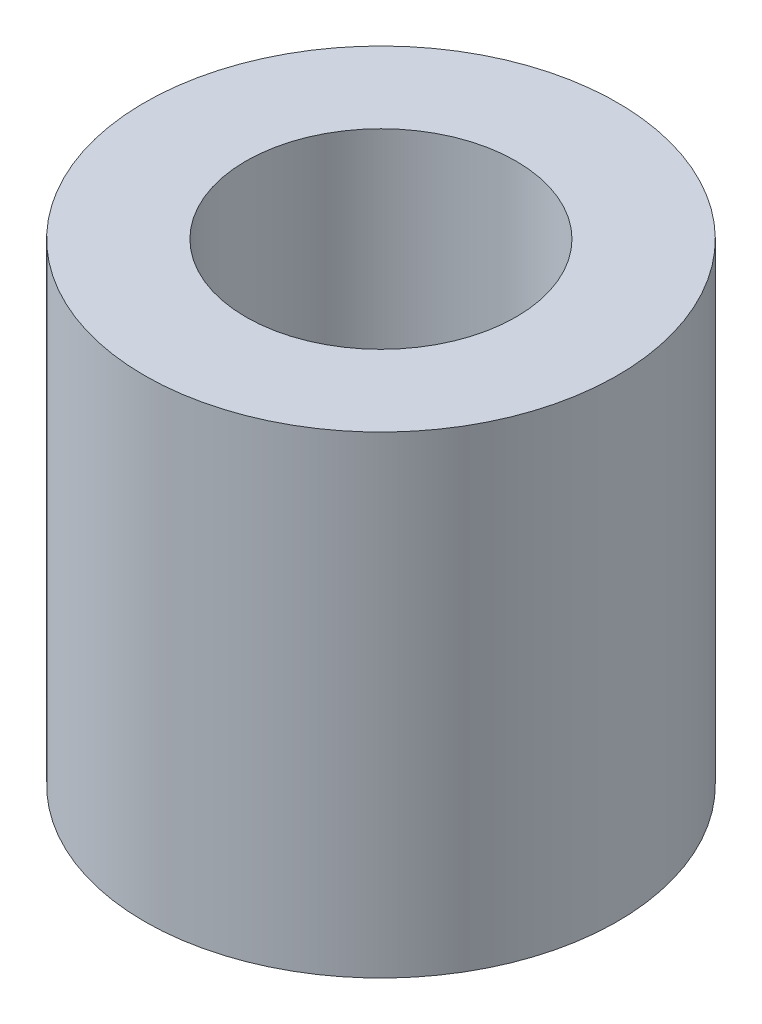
ISO-10303-21;
HEADER;
FILE_DESCRIPTION(('STEP AP214'),'2;1');
FILE_NAME('part.step','',(''),(''),'','','');
FILE_SCHEMA(('AUTOMOTIVE_DESIGN { 1 0 10303 214 1 1 1 1 }'));
ENDSEC;
DATA;
#1=APPLICATION_CONTEXT('core data for automotive mechanical design processes');
#2=APPLICATION_PROTOCOL_DEFINITION('international standard','automotive_design',2000,#1);
#3=PRODUCT_CONTEXT('',#1,'mechanical');
#4=PRODUCT('Part','Part','',(#3));
#5=PRODUCT_RELATED_PRODUCT_CATEGORY('part','',(#4));
#6=PRODUCT_DEFINITION_FORMATION('','',#4);
#7=PRODUCT_DEFINITION_CONTEXT('part definition',#1,'design');
#8=PRODUCT_DEFINITION('design','',#6,#7);
#9=PRODUCT_DEFINITION_SHAPE('','',#8);
#10=(LENGTH_UNIT() NAMED_UNIT(*) SI_UNIT(.MILLI.,.METRE.));
#11=(NAMED_UNIT(*) PLANE_ANGLE_UNIT() SI_UNIT($,.RADIAN.));
#12=(NAMED_UNIT(*) SI_UNIT($,.STERADIAN.) SOLID_ANGLE_UNIT());
#13=UNCERTAINTY_MEASURE_WITH_UNIT(LENGTH_MEASURE(1.E-05),#10,'distance_accuracy_value','');
#14=(GEOMETRIC_REPRESENTATION_CONTEXT(3) GLOBAL_UNCERTAINTY_ASSIGNED_CONTEXT((#13)) GLOBAL_UNIT_ASSIGNED_CONTEXT((#10,
#11,#12)) REPRESENTATION_CONTEXT('',''));
#15=CARTESIAN_POINT('',(0.,0.,0.));
#16=DIRECTION('',(0.,0.,1.));
#17=DIRECTION('',(1.,0.,0.));
#18=AXIS2_PLACEMENT_3D('',#15,#16,#17);
#19=CARTESIAN_POINT('',(0.,350.,0.));
#20=DIRECTION('',(0.,1.,0.));
#21=DIRECTION('',(0.,0.,1.));
#22=AXIS2_PLACEMENT_3D('',#19,#20,#21);
#23=PLANE('',#22);
#24=CARTESIAN_POINT('',(0.,350.,0.));
#25=DIRECTION('',(0.,1.,0.));
#26=DIRECTION('',(0.,0.,1.));
#27=AXIS2_PLACEMENT_3D('',#24,#25,#26);
#28=CIRCLE('',#27,175.);
#29=CARTESIAN_POINT('',(0.,350.,175.));
#30=VERTEX_POINT('',#29);
#31=EDGE_CURVE('E10',#30,#30,#28,.T.);
#32=ORIENTED_EDGE('',*,*,#31,.T.);
#33=EDGE_LOOP('',(#32));
#34=FACE_BOUND('',#33,.T.);
#35=CARTESIAN_POINT('',(0.,350.,0.));
#36=DIRECTION('',(0.,1.,0.));
#37=DIRECTION('',(0.,0.,1.));
#38=AXIS2_PLACEMENT_3D('',#35,#36,#37);
#39=CIRCLE('',#38,100.);
#40=CARTESIAN_POINT('',(0.,350.,100.));
#41=VERTEX_POINT('',#40);
#42=EDGE_CURVE('E42',#41,#41,#39,.T.);
#43=ORIENTED_EDGE('',*,*,#42,.F.);
#44=EDGE_LOOP('',(#43));
#45=FACE_BOUND('',#44,.T.);
#46=ADVANCED_FACE('F31',(#34,#45),#23,.T.);
#47=CARTESIAN_POINT('',(0.,0.,0.));
#48=DIRECTION('',(0.,1.,0.));
#49=DIRECTION('',(0.,0.,1.));
#50=AXIS2_PLACEMENT_3D('',#47,#48,#49);
#51=PLANE('',#50);
#52=CARTESIAN_POINT('',(0.,0.,0.));
#53=DIRECTION('',(0.,1.,0.));
#54=DIRECTION('',(0.,0.,1.));
#55=AXIS2_PLACEMENT_3D('',#52,#53,#54);
#56=CIRCLE('',#55,175.);
#57=CARTESIAN_POINT('',(0.,0.,175.));
#58=VERTEX_POINT('',#57);
#59=EDGE_CURVE('E35',#58,#58,#56,.T.);
#60=ORIENTED_EDGE('',*,*,#59,.F.);
#61=EDGE_LOOP('',(#60));
#62=FACE_BOUND('',#61,.T.);
#63=CARTESIAN_POINT('',(0.,0.,0.));
#64=DIRECTION('',(0.,1.,0.));
#65=DIRECTION('',(0.,0.,1.));
#66=AXIS2_PLACEMENT_3D('',#63,#64,#65);
#67=CIRCLE('',#66,100.);
#68=CARTESIAN_POINT('',(0.,0.,100.));
#69=VERTEX_POINT('',#68);
#70=EDGE_CURVE('E44',#69,#69,#67,.T.);
#71=ORIENTED_EDGE('',*,*,#70,.T.);
#72=EDGE_LOOP('',(#71));
#73=FACE_BOUND('',#72,.T.);
#74=ADVANCED_FACE('F54',(#62,#73),#51,.F.);
#75=CARTESIAN_POINT('',(0.,350.,0.));
#76=DIRECTION('',(0.,-1.,0.));
#77=DIRECTION('',(0.,0.,-1.));
#78=AXIS2_PLACEMENT_3D('',#75,#76,#77);
#79=CYLINDRICAL_SURFACE('',#78,175.);
#80=ORIENTED_EDGE('',*,*,#31,.F.);
#81=EDGE_LOOP('',(#80));
#82=FACE_BOUND('',#81,.T.);
#83=ORIENTED_EDGE('',*,*,#59,.T.);
#84=EDGE_LOOP('',(#83));
#85=FACE_BOUND('',#84,.T.);
#86=ADVANCED_FACE('F33',(#82,#85),#79,.T.);
#87=CARTESIAN_POINT('',(0.,350.,0.));
#88=DIRECTION('',(0.,-1.,0.));
#89=DIRECTION('',(0.,0.,-1.));
#90=AXIS2_PLACEMENT_3D('',#87,#88,#89);
#91=CYLINDRICAL_SURFACE('',#90,100.);
#92=ORIENTED_EDGE('',*,*,#42,.T.);
#93=EDGE_LOOP('',(#92));
#94=FACE_BOUND('',#93,.T.);
#95=ORIENTED_EDGE('',*,*,#70,.F.);
#96=EDGE_LOOP('',(#95));
#97=FACE_BOUND('',#96,.T.);
#98=ADVANCED_FACE('F50',(#94,#97),#91,.F.);
#99=CLOSED_SHELL('',(#46,#74,#86,#98));
#100=MANIFOLD_SOLID_BREP('B2',#99);
#101=ADVANCED_BREP_SHAPE_REPRESENTATION('',(#18,#100),#14);
#102=SHAPE_DEFINITION_REPRESENTATION(#9,#101);
ENDSEC;
END-ISO-10303-21;
